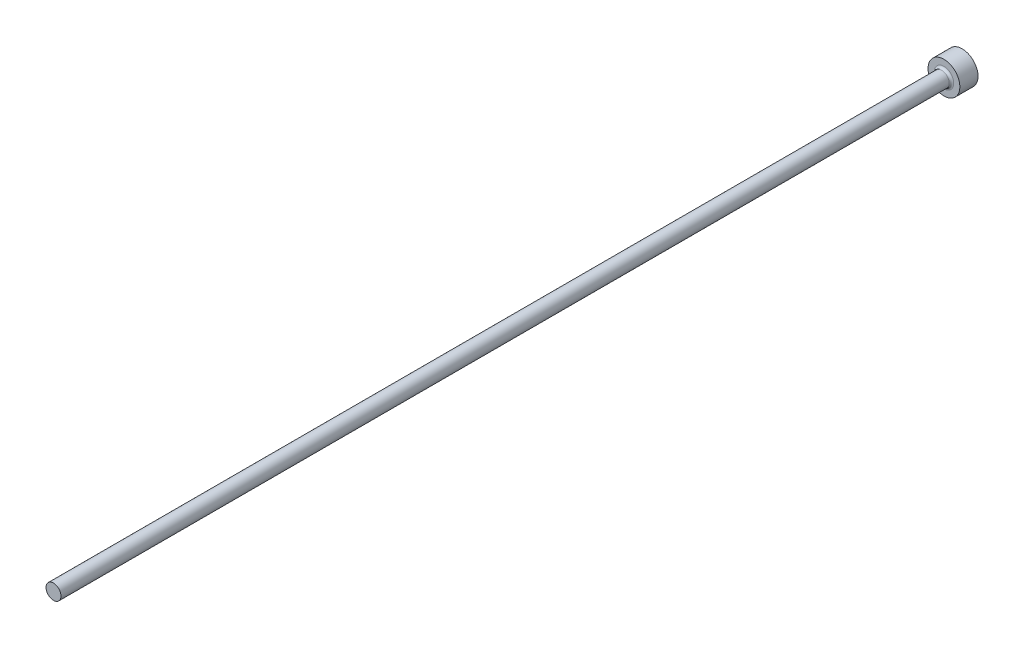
from build123d import *

# Parameters (mm, degrees)
FILLET1_R = 0.5


with BuildPart() as part:
    # FV → Revolve1 (revolve)
    with BuildSketch(Plane(origin=(0, 0, 0), x_dir=(1, 0, 0), z_dir=(0, 1, 0)), mode=Mode.PRIVATE) as revolve1_sk:
        Polygon((0, 0), (3.5, 0), (3.5, -4), (1.65, -4), (1.65, -200), (0, -200), align=None)
    revolve(revolve1_sk.sketch.rotate(Axis((0, 0, -9.033228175), (0, 0, 1)), 180), axis=Axis((0, 0, -9.033228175), (0, 0, 1)))

    # Fillet1
    fillet1_edges = [part.edges().sort_by_distance(p)[0] for p in [
        (1.65, 0, 4),
    ]]
    fillet(fillet1_edges, radius=FILLET1_R)


solid = part.part
